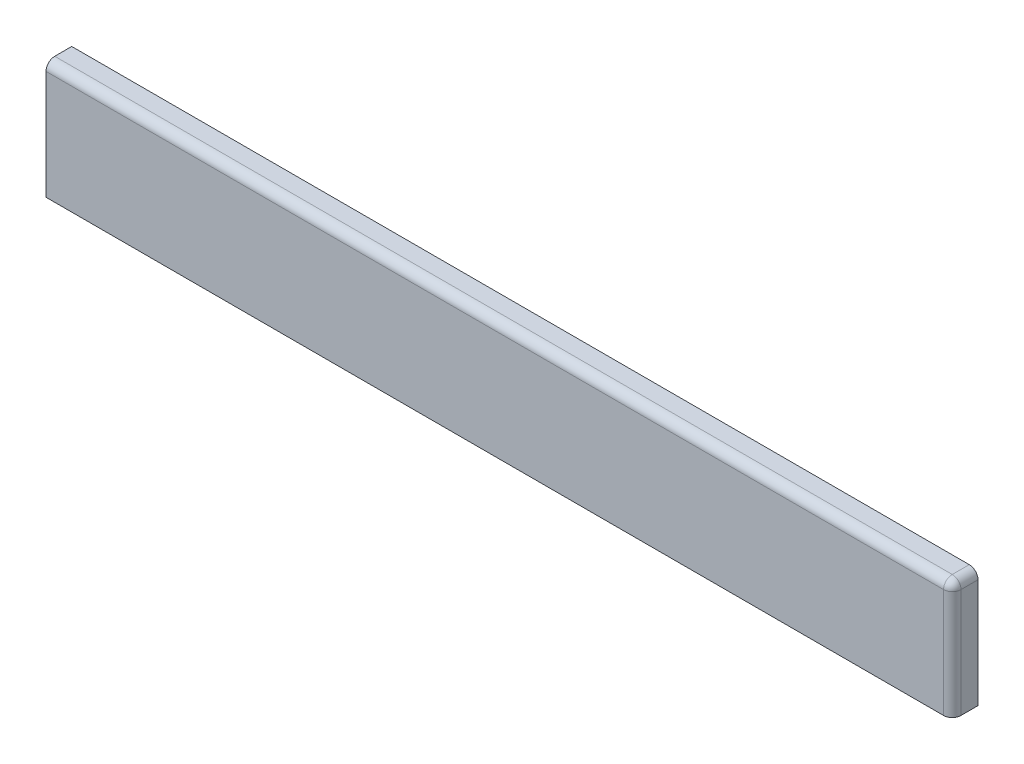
from build123d import *

# Parameters (mm, degrees)
SKETCH_1_W          = 2018
SKETCH_1_H          = 270
SKETCH_1_R          = 5
EXTRUDE_1_DEPTH     = 16
SKETCH_2_R          = 5
CUT_EXTRUDE_1_DEPTH = 1045.622898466
EXTRUDE_START       = -16
SKETCH_3_W          = 2018
SKETCH_3_H          = 270
EXTRUDE_2_DEPTH     = 43
FILLET_1_R          = 20
MOVE_FACE_2_BY      = 60
FILLET_2_R          = 20


with BuildPart() as part:
    # Sketch 1 → Extrude 1 (new body)
    with BuildSketch(Plane.XY):
        with Locations((0, -135)):
            Rectangle(SKETCH_1_W, SKETCH_1_H)
        with Locations((929, -113)):
            Circle(SKETCH_1_R, mode=Mode.SUBTRACT)
        with Locations((29, -113)):
            Circle(SKETCH_1_R, mode=Mode.SUBTRACT)
        with Locations((479, -113)):
            Circle(SKETCH_1_R, mode=Mode.SUBTRACT)
        with Locations((976, -160)):
            Circle(SKETCH_1_R, mode=Mode.SUBTRACT)
        with Locations((976, -240)):
            Circle(SKETCH_1_R, mode=Mode.SUBTRACT)
        with Locations((-976, -240)):
            Circle(SKETCH_1_R, mode=Mode.SUBTRACT)
        with Locations((-976, -160)):
            Circle(SKETCH_1_R, mode=Mode.SUBTRACT)
        with Locations((-897.5, -255)):
            Circle(SKETCH_1_R, mode=Mode.SUBTRACT)
        with Locations((-299.166666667, -255)):
            Circle(SKETCH_1_R, mode=Mode.SUBTRACT)
        with Locations((299.166666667, -255)):
            Circle(SKETCH_1_R, mode=Mode.SUBTRACT)
        with Locations((897.5, -255)):
            Circle(SKETCH_1_R, mode=Mode.SUBTRACT)
    extrude(amount=EXTRUDE_1_DEPTH)

    # Sketch 2 → Cut-Extrude 1 (cut, through all)
    with BuildSketch(Plane(origin=(0, 0, 0), x_dir=(-1, 0, 0), z_dir=(0, 0, -1))):
        with Locations((173.067802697, -191.991381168)):
            Circle(SKETCH_2_R)
        with Locations((174.08475185, -132)):
            Circle(SKETCH_2_R)
        with Locations((764, -142)):
            Circle(SKETCH_2_R)
        with Locations((762.983050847, -201.991381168)):
            Circle(SKETCH_2_R)
    extrude(amount=-CUT_EXTRUDE_1_DEPTH, mode=Mode.SUBTRACT)

    # Sketch 3 → Extrude 2 (add)
    with BuildSketch(Plane(origin=(0, 0, 0), x_dir=(-1, 0, 0), z_dir=(0, 0, -1)).offset(EXTRUDE_START)):
        with Locations((0, -135)):
            Rectangle(SKETCH_3_W, SKETCH_3_H)
    extrude(amount=-EXTRUDE_2_DEPTH)

    # Fillet 1
    fillet_1_edges = [part.edges().sort_by_distance(p)[0] for p in [
        (0, 0, 59),
    ]]
    fillet(fillet_1_edges, radius=FILLET_1_R)

    # Move Face 2: a face moved outward by 60.0
    extrude(part.faces().sort_by_distance((1009, -135.707201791, 29.364377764))[0], amount=MOVE_FACE_2_BY, dir=(1, 0, 0))

    # Fillet 2
    fillet_2_edges = [part.edges().sort_by_distance(p)[0] for p in [
        (1069, 0, 19.5),
        (1069, -145, 59),
        (1069, -5.857864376, 53.142135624),
    ]]
    fillet(fillet_2_edges, radius=FILLET_2_R)


solid = part.part
